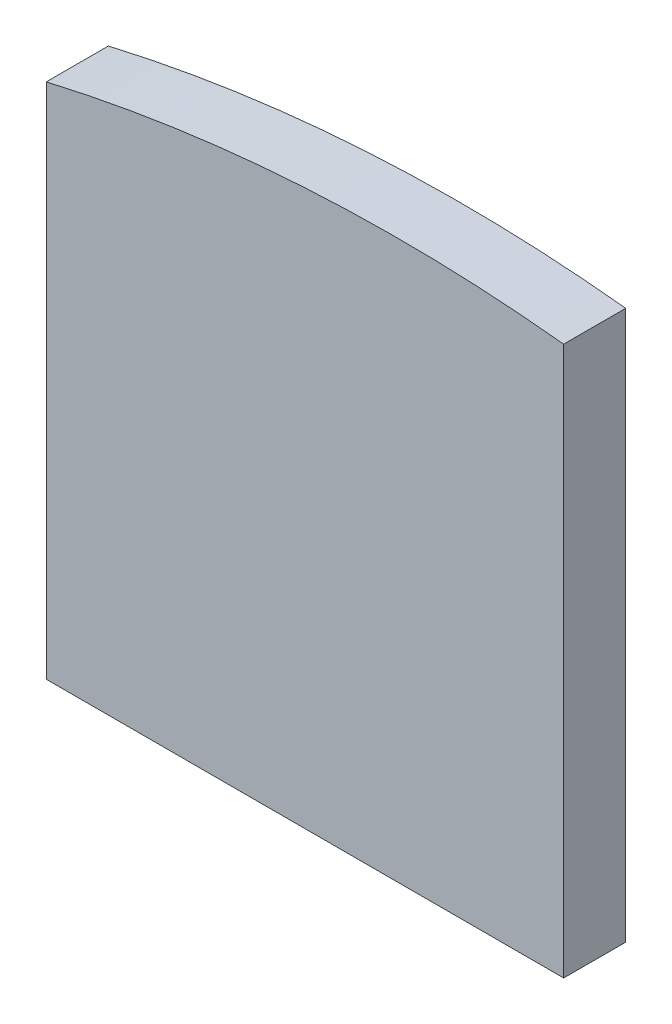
from build123d import *

# Parameters (mm, degrees)
EXTRUDE1_DEPTH = 12


with BuildPart() as part:
    # Sketch1 → Extrude1 (new body)
    with BuildSketch(Plane.XY):
        with BuildLine():
            Line((-68, 292.191717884), (-68, 192.191717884))
            Line((-68, 192.191717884), (32, 192.191717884))
            Line((32, 192.191717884), (32, 298.288451))
            ThreePointArc((32, 298.288451), (-18.256301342, 299.443997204), (-68, 292.191717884))
        make_face()
    extrude(amount=EXTRUDE1_DEPTH)


solid = part.part
